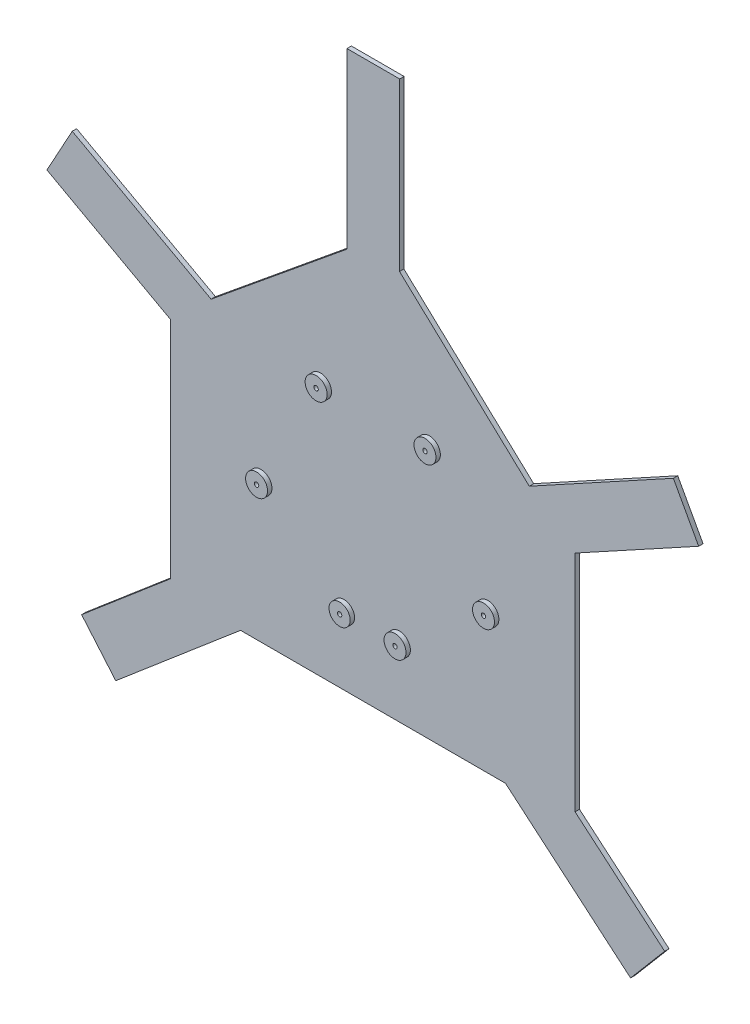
from build123d import *

# Parameters (mm, degrees)
SKETCH1_R           = 2.5
SKETCH1_R_2         = 2.408517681
BOSS_EXTRUDE1_DEPTH = 1
SKETCH1_5_R         = 2.5
SKETCH1_5_R_2       = 0.5
SKETCH1_5_R_3       = 2.408517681
BOSS_EXTRUDE2_DEPTH = 2


with BuildPart() as part:
    # Sketch1 → Boss-Extrude1 (new body)
    with BuildSketch(Plane.XY):
        Polygon((-11.296794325, 81.63498138), (16.844878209, 66.225560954), (16.844878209, 15.125179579), (-3.403951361, -2.080125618), (4.366204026, -11.224778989), (32.777648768, 12.916249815), (93.089891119, 12.916249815), (121.568198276, -11.231302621), (129.328963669, -2.078678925), (108.93431821, 15.214510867), (108.93431821, 66.225584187), (137.073736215, 81.635028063), (131.310029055, 92.160220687), (98.514779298, 74.201193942), (68.965283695, 101.756540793), (69.01117932, 139.735128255), (57.011170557, 139.735128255), (56.963327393, 100.144953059), (26.076720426, 74.85172107), (-5.533449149, 92.160372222), align=None)
        with Locations((68.945466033, 28.372721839)):
            Circle(SKETCH1_R, mode=Mode.SUBTRACT)
        with Locations((89.090105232, 44.468761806)):
            Circle(SKETCH1_R, mode=Mode.SUBTRACT)
        with Locations((50.983394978, 70.266444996)):
            Circle(SKETCH1_R, mode=Mode.SUBTRACT)
        with Locations((75.767111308, 70.266444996)):
            Circle(SKETCH1_R, mode=Mode.SUBTRACT)
        with Locations((37.427290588, 44.468761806)):
            Circle(SKETCH1_R, mode=Mode.SUBTRACT)
        with Locations((56.328190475, 28.372721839)):
            Circle(SKETCH1_R_2, mode=Mode.SUBTRACT)
    extrude(amount=BOSS_EXTRUDE1_DEPTH)

    # Sketch1_5 → Boss-Extrude2 (add)
    # profile 1 of 6: a face of its own
    with BuildSketch(Plane.XY):
        with Locations((68.945466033, 28.372721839)):
            Circle(SKETCH1_5_R)
        with Locations((68.945466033, 28.372721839)):
            Circle(SKETCH1_5_R_2, mode=Mode.SUBTRACT)
    # profile 2 of 6: a face of its own
    with BuildSketch(Plane.XY):
        with Locations((56.328190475, 28.372721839)):
            Circle(SKETCH1_5_R_3)
        with Locations((56.328190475, 28.372721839)):
            Circle(SKETCH1_5_R_2, mode=Mode.SUBTRACT)
    # profile 3 of 6: a face of its own
    with BuildSketch(Plane.XY):
        with Locations((37.427290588, 44.468761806)):
            Circle(SKETCH1_5_R)
        with Locations((37.427290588, 44.468761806)):
            Circle(SKETCH1_5_R_2, mode=Mode.SUBTRACT)
    # profile 4 of 6: a face of its own
    with BuildSketch(Plane.XY):
        with Locations((50.983394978, 70.266444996)):
            Circle(SKETCH1_5_R)
        with Locations((50.983394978, 70.266444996)):
            Circle(SKETCH1_5_R_2, mode=Mode.SUBTRACT)
    # profile 5 of 6: a face of its own
    with BuildSketch(Plane.XY):
        with Locations((75.767111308, 70.266444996)):
            Circle(SKETCH1_5_R)
        with Locations((75.767111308, 70.266444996)):
            Circle(SKETCH1_5_R_2, mode=Mode.SUBTRACT)
    # profile 6 of 6: a face of its own
    with BuildSketch(Plane.XY):
        with Locations((89.090105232, 44.468761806)):
            Circle(SKETCH1_5_R)
        with Locations((89.090105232, 44.468761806)):
            Circle(SKETCH1_5_R_2, mode=Mode.SUBTRACT)
    extrude(amount=BOSS_EXTRUDE2_DEPTH)


solid = part.part
